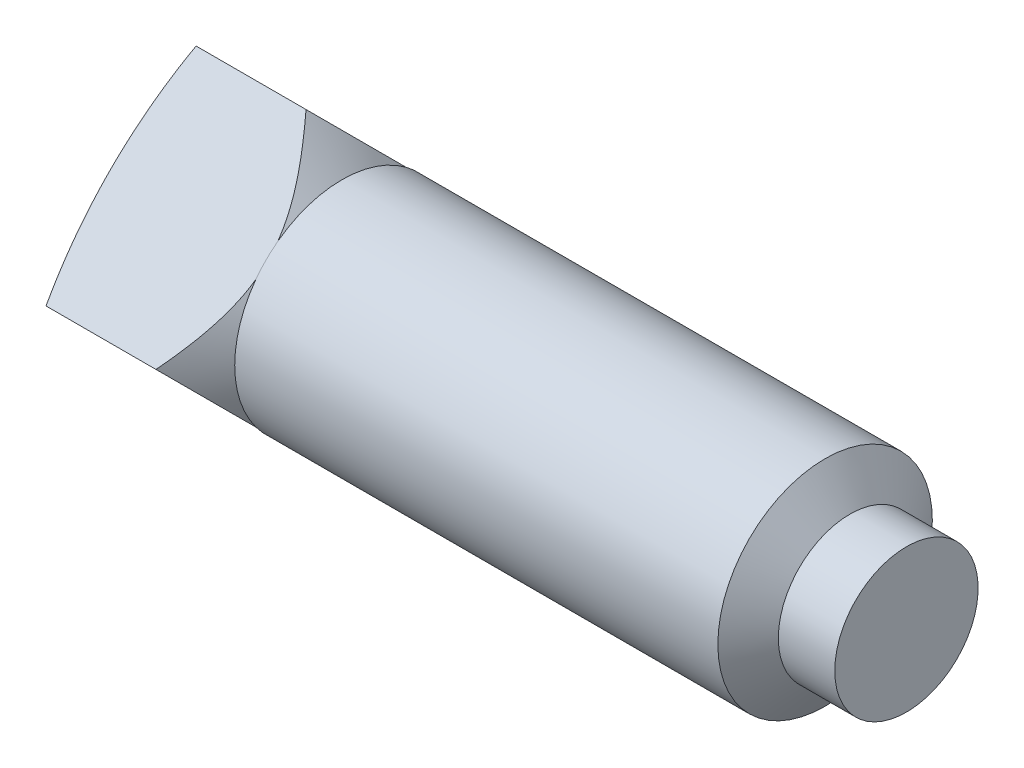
ISO-10303-21;
HEADER;
FILE_DESCRIPTION(('STEP AP214'),'2;1');
FILE_NAME('part.step','',(''),(''),'','','');
FILE_SCHEMA(('AUTOMOTIVE_DESIGN { 1 0 10303 214 1 1 1 1 }'));
ENDSEC;
DATA;
#1=APPLICATION_CONTEXT('core data for automotive mechanical design processes');
#2=APPLICATION_PROTOCOL_DEFINITION('international standard','automotive_design',2000,#1);
#3=PRODUCT_CONTEXT('',#1,'mechanical');
#4=PRODUCT('Part','Part','',(#3));
#5=PRODUCT_RELATED_PRODUCT_CATEGORY('part','',(#4));
#6=PRODUCT_DEFINITION_FORMATION('','',#4);
#7=PRODUCT_DEFINITION_CONTEXT('part definition',#1,'design');
#8=PRODUCT_DEFINITION('design','',#6,#7);
#9=PRODUCT_DEFINITION_SHAPE('','',#8);
#10=(LENGTH_UNIT() NAMED_UNIT(*) SI_UNIT(.MILLI.,.METRE.));
#11=(NAMED_UNIT(*) PLANE_ANGLE_UNIT() SI_UNIT($,.RADIAN.));
#12=(NAMED_UNIT(*) SI_UNIT($,.STERADIAN.) SOLID_ANGLE_UNIT());
#13=UNCERTAINTY_MEASURE_WITH_UNIT(LENGTH_MEASURE(1.E-05),#10,'distance_accuracy_value','');
#14=(GEOMETRIC_REPRESENTATION_CONTEXT(3) GLOBAL_UNCERTAINTY_ASSIGNED_CONTEXT((#13)) GLOBAL_UNIT_ASSIGNED_CONTEXT((#10,
#11,#12)) REPRESENTATION_CONTEXT('',''));
#15=CARTESIAN_POINT('',(0.,0.,0.));
#16=DIRECTION('',(0.,0.,1.));
#17=DIRECTION('',(1.,0.,0.));
#18=AXIS2_PLACEMENT_3D('',#15,#16,#17);
#19=CARTESIAN_POINT('',(-3.7592,0.,-3.376576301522));
#20=DIRECTION('',(0.,-0.707106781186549,0.707106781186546));
#21=DIRECTION('',(0.,-0.707106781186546,-0.707106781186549));
#22=AXIS2_PLACEMENT_3D('',#19,#20,#21);
#23=PLANE('',#22);
#24=CARTESIAN_POINT('',(-3.71463670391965,-2.84404188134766,-6.22061818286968));
#25=CARTESIAN_POINT('',(-3.55613835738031,-2.7014684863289,-6.07804478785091));
#26=CARTESIAN_POINT('',(-3.3981461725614,-2.55860959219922,-5.93518589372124));
#27=CARTESIAN_POINT('',(-3.08363247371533,-2.27203984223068,-5.64861614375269));
#28=CARTESIAN_POINT('',(-2.92711125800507,-2.12832882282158,-5.50490512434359));
#29=CARTESIAN_POINT('',(-2.61537743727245,-1.83919610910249,-5.2157724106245));
#30=CARTESIAN_POINT('',(-2.46017361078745,-1.69376967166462,-5.07034597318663));
#31=CARTESIAN_POINT('',(-2.15261018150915,-1.40143979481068,-4.77801609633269));
#32=CARTESIAN_POINT('',(-2.00025026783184,-1.25453651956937,-4.63111282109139));
#33=CARTESIAN_POINT('',(-1.72970912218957,-0.988182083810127,-4.36475838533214));
#34=CARTESIAN_POINT('',(-1.6107818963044,-0.869111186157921,-4.24568748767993));
#35=CARTESIAN_POINT('',(-1.37665028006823,-0.629105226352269,-4.00568152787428));
#36=CARTESIAN_POINT('',(-1.2614467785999,-0.508169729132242,-3.88474603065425));
#37=CARTESIAN_POINT('',(-1.03648369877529,-0.263755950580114,-3.64033225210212));
#38=CARTESIAN_POINT('',(-0.92672420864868,-0.140277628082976,-3.51685392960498));
#39=CARTESIAN_POINT('',(-0.768411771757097,0.0475823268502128,-3.32899397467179));
#40=CARTESIAN_POINT('',(-0.716703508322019,0.110632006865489,-3.26594429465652));
#41=CARTESIAN_POINT('',(-0.615958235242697,0.237786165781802,-3.13879013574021));
#42=CARTESIAN_POINT('',(-0.566920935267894,0.301890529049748,-3.07468577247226));
#43=CARTESIAN_POINT('',(-0.470564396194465,0.433616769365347,-2.94295953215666));
#44=CARTESIAN_POINT('',(-0.423365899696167,0.501283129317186,-2.87529317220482));
#45=CARTESIAN_POINT('',(-0.333664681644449,0.638144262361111,-2.73843203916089));
#46=CARTESIAN_POINT('',(-0.291160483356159,0.707338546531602,-2.6692377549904));
#47=CARTESIAN_POINT('',(-0.21229503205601,0.847303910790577,-2.52927239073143));
#48=CARTESIAN_POINT('',(-0.175920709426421,0.918071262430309,-2.4585050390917));
#49=CARTESIAN_POINT('',(-0.110910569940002,1.06137320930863,-2.31520309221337));
#50=CARTESIAN_POINT('',(-0.0822720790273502,1.1339071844,-2.24266911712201));
#51=CARTESIAN_POINT('',(-0.0393755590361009,1.26582470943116,-2.11075159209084));
#52=CARTESIAN_POINT('',(-0.0233846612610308,1.3249242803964,-2.0516520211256));
#53=CARTESIAN_POINT('',(0.00161538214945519,1.44386018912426,-1.93271611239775));
#54=CARTESIAN_POINT('',(0.0106258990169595,1.50369637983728,-1.87287992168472));
#55=CARTESIAN_POINT('',(0.021092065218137,1.62355655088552,-1.75301975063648));
#56=CARTESIAN_POINT('',(0.0225662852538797,1.68357970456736,-1.69299659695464));
#57=CARTESIAN_POINT('',(0.0179155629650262,1.80348109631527,-1.57309520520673));
#58=CARTESIAN_POINT('',(0.0117896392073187,1.86335931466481,-1.51321698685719));
#59=CARTESIAN_POINT('',(-0.0100815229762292,1.99721927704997,-1.37935702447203));
#60=CARTESIAN_POINT('',(-0.0278264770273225,2.0710373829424,-1.3055389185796));
#61=CARTESIAN_POINT('',(-0.0730208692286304,2.21718932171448,-1.15938697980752));
#62=CARTESIAN_POINT('',(-0.100477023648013,2.28952209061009,-1.08705421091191));
#63=CARTESIAN_POINT('',(-0.147658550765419,2.39694211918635,-0.97963418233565));
#64=CARTESIAN_POINT('',(-0.164455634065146,2.43269379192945,-0.943882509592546));
#65=CARTESIAN_POINT('',(-0.199813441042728,2.50374093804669,-0.872835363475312));
#66=CARTESIAN_POINT('',(-0.218373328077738,2.5390366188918,-0.837539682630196));
#67=CARTESIAN_POINT('',(-0.257053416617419,2.60919264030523,-0.76738366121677));
#68=CARTESIAN_POINT('',(-0.277173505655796,2.64405301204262,-0.73252328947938));
#69=CARTESIAN_POINT('',(-0.318791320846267,2.71336326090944,-0.663213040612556));
#70=CARTESIAN_POINT('',(-0.340289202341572,2.74781309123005,-0.628763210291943));
#71=CARTESIAN_POINT('',(-0.403215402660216,2.84534321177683,-0.53123308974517));
#72=CARTESIAN_POINT('',(-0.446099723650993,2.90795472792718,-0.468621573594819));
#73=CARTESIAN_POINT('',(-0.535121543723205,3.0320152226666,-0.344561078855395));
#74=CARTESIAN_POINT('',(-0.581259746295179,3.09346394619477,-0.283112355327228));
#75=CARTESIAN_POINT('',(-0.723571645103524,3.27639274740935,-0.100183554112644));
#76=CARTESIAN_POINT('',(-0.823588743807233,3.39637526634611,0.0197989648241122));
#77=CARTESIAN_POINT('',(-1.03047356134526,3.63375592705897,0.257179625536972));
#78=CARTESIAN_POINT('',(-1.13735948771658,3.75114599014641,0.374569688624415));
#79=CARTESIAN_POINT('',(-1.35557896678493,3.9837660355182,0.607189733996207));
#80=CARTESIAN_POINT('',(-1.4669107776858,4.09899683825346,0.722420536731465));
#81=CARTESIAN_POINT('',(-1.69305612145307,4.3282350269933,0.951658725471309));
#82=CARTESIAN_POINT('',(-1.8078789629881,4.44223779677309,1.06566149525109));
#83=CARTESIAN_POINT('',(-2.03983717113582,4.66907271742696,1.29249641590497));
#84=CARTESIAN_POINT('',(-2.1569727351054,4.78190476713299,1.405328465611));
#85=CARTESIAN_POINT('',(-2.39279712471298,5.00650286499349,1.6299265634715));
#86=CARTESIAN_POINT('',(-2.51148349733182,5.11827020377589,1.7416939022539));
#87=CARTESIAN_POINT('',(-2.75017246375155,5.34109999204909,1.9645236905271));
#88=CARTESIAN_POINT('',(-2.87017506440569,5.45216243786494,2.07558613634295));
#89=CARTESIAN_POINT('',(-3.05068333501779,5.61808795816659,2.2415116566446));
#90=CARTESIAN_POINT('',(-3.11080136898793,5.67316227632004,2.29658597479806));
#91=CARTESIAN_POINT('',(-3.23127854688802,5.78319708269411,2.40662078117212));
#92=CARTESIAN_POINT('',(-3.29163773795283,5.83815754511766,2.46158124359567));
#93=CARTESIAN_POINT('',(-3.41233885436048,5.94776482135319,2.5711885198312));
#94=CARTESIAN_POINT('',(-3.47268003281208,6.00241204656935,2.62583574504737));
#95=CARTESIAN_POINT('',(-3.59353260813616,6.11159399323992,2.73501769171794));
#96=CARTESIAN_POINT('',(-3.65404396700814,6.16612873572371,2.78955243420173));
#97=CARTESIAN_POINT('',(-3.71463670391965,6.22061818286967,2.84404188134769));
#98=B_SPLINE_CURVE_WITH_KNOTS('',3,(#24,#25,#26,#27,#28,#29,#30,#31,#32,#33,#34,#35,#36,#37,#38,
#39,#40,#41,#42,#43,#44,#45,#46,#47,#48,#49,#50,#51,#52,#53,#54,#55,#56,#57,#58,#59,#60,#61,#62,
#63,#64,#65,#66,#67,#68,#69,#70,#71,#72,#73,#74,#75,#76,#77,#78,#79,#80,#81,#82,#83,#84,#85,#86,
#87,#88,#89,#90,#91,#92,#93,#94,#95,#96,#97),.UNSPECIFIED.,.F.,.F.,(4,2,2,2,2,2,2,2,2,2,2,2,2,2,
2,2,2,2,2,2,2,2,2,2,2,2,2,2,2,2,2,2,2,2,2,2,4),(0.,0.769411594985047,1.53897600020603,
2.31192373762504,3.08478647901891,3.70321119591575,4.32178246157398,4.94036374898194,
5.24955145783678,5.55870549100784,5.87871228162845,6.19861811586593,6.51783299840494,
6.83693739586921,7.0919662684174,7.3469450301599,7.60129517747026,7.8556781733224,
8.17279662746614,8.49013483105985,8.64994152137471,8.80967274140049,8.96939245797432,
9.12913021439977,9.42418817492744,9.71931012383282,10.3099299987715,10.9021857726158,
11.4942117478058,12.0879855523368,12.6818102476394,13.2747881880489,13.8677692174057,
14.1629380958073,14.4581678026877,14.7523159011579,15.0464028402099),.UNSPECIFIED.);
#99=CARTESIAN_POINT('',(-0.808536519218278,0.,-3.376576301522));
#100=VERTEX_POINT('',#99);
#101=CARTESIAN_POINT('',(0.,1.44137193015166,-1.93520437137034));
#102=VERTEX_POINT('',#101);
#103=EDGE_CURVE('E166',#100,#102,#98,.T.);
#104=ORIENTED_EDGE('',*,*,#103,.F.);
#105=DIRECTION('',(1.,0.,0.));
#106=VECTOR('',#105,1.);
#107=CARTESIAN_POINT('',(-3.7592,0.,-3.376576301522));
#108=LINE('',#107,#106);
#109=CARTESIAN_POINT('',(-3.2823012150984,0.,-3.376576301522));
#110=VERTEX_POINT('',#109);
#111=EDGE_CURVE('E147',#110,#100,#108,.T.);
#112=ORIENTED_EDGE('',*,*,#111,.F.);
#113=CARTESIAN_POINT('',(8.4328,1.688288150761,-1.688288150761));
#114=DIRECTION('',(0.,-0.707106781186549,0.707106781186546));
#115=DIRECTION('',(0.,-0.707106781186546,-0.707106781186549));
#116=AXIS2_PLACEMENT_3D('',#113,#114,#115);
#117=CIRCLE('',#116,11.9559286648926);
#118=CARTESIAN_POINT('',(-3.2823012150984,3.376576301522,0.));
#119=VERTEX_POINT('',#118);
#120=EDGE_CURVE('E156',#119,#110,#117,.T.);
#121=ORIENTED_EDGE('',*,*,#120,.F.);
#122=DIRECTION('',(1.,0.,0.));
#123=VECTOR('',#122,1.);
#124=CARTESIAN_POINT('',(-3.7592,3.376576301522,0.));
#125=LINE('',#124,#123);
#126=CARTESIAN_POINT('',(-0.808536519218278,3.376576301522,0.));
#127=VERTEX_POINT('',#126);
#128=EDGE_CURVE('E154',#119,#127,#125,.T.);
#129=ORIENTED_EDGE('',*,*,#128,.T.);
#130=CARTESIAN_POINT('',(0.,1.93520437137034,-1.44137193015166));
#131=VERTEX_POINT('',#130);
#132=EDGE_CURVE('E177',#131,#127,#98,.T.);
#133=ORIENTED_EDGE('',*,*,#132,.F.);
#134=DIRECTION('',(0.,-0.707106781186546,-0.707106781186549));
#135=VECTOR('',#134,1.);
#136=CARTESIAN_POINT('',(0.,0.,-3.376576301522));
#137=LINE('',#136,#135);
#138=EDGE_CURVE('E47',#131,#102,#137,.T.);
#139=ORIENTED_EDGE('',*,*,#138,.T.);
#140=EDGE_LOOP('',(#104,#112,#121,#129,#133,#139));
#141=FACE_BOUND('',#140,.T.);
#142=ADVANCED_FACE('F39',(#141),#23,.F.);
#143=CARTESIAN_POINT('',(-3.7592,0.,-3.376576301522));
#144=DIRECTION('',(0.,0.707106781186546,0.707106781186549));
#145=DIRECTION('',(0.,-0.707106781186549,0.707106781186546));
#146=AXIS2_PLACEMENT_3D('',#143,#144,#145);
#147=PLANE('',#146);
#148=CARTESIAN_POINT('',(-3.71463670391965,-6.22061818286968,2.84404188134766));
#149=CARTESIAN_POINT('',(-3.55613835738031,-6.07804478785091,2.7014684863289));
#150=CARTESIAN_POINT('',(-3.3981461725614,-5.93518589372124,2.55860959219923));
#151=CARTESIAN_POINT('',(-3.08363247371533,-5.64861614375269,2.27203984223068));
#152=CARTESIAN_POINT('',(-2.92711125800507,-5.50490512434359,2.12832882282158));
#153=CARTESIAN_POINT('',(-2.61537743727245,-5.2157724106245,1.83919610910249));
#154=CARTESIAN_POINT('',(-2.46017361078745,-5.07034597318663,1.69376967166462));
#155=CARTESIAN_POINT('',(-2.15261018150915,-4.77801609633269,1.40143979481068));
#156=CARTESIAN_POINT('',(-2.00025026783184,-4.63111282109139,1.25453651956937));
#157=CARTESIAN_POINT('',(-1.72970912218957,-4.36475838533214,0.988182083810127));
#158=CARTESIAN_POINT('',(-1.6107818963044,-4.24568748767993,0.869111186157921));
#159=CARTESIAN_POINT('',(-1.37665028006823,-4.00568152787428,0.629105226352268));
#160=CARTESIAN_POINT('',(-1.2614467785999,-3.88474603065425,0.508169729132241));
#161=CARTESIAN_POINT('',(-1.03648369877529,-3.64033225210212,0.263755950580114));
#162=CARTESIAN_POINT('',(-0.92672420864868,-3.51685392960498,0.140277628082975));
#163=CARTESIAN_POINT('',(-0.768411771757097,-3.32899397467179,-0.0475823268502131));
#164=CARTESIAN_POINT('',(-0.716703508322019,-3.26594429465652,-0.11063200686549));
#165=CARTESIAN_POINT('',(-0.615958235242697,-3.13879013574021,-0.237786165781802));
#166=CARTESIAN_POINT('',(-0.566920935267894,-3.07468577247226,-0.301890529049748));
#167=CARTESIAN_POINT('',(-0.470564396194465,-2.94295953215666,-0.433616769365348));
#168=CARTESIAN_POINT('',(-0.423365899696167,-2.87529317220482,-0.501283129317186));
#169=CARTESIAN_POINT('',(-0.333664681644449,-2.73843203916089,-0.638144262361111));
#170=CARTESIAN_POINT('',(-0.291160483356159,-2.6692377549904,-0.707338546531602));
#171=CARTESIAN_POINT('',(-0.21229503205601,-2.52927239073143,-0.847303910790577));
#172=CARTESIAN_POINT('',(-0.175920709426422,-2.4585050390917,-0.918071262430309));
#173=CARTESIAN_POINT('',(-0.110910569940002,-2.31520309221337,-1.06137320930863));
#174=CARTESIAN_POINT('',(-0.0822720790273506,-2.24266911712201,-1.1339071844));
#175=CARTESIAN_POINT('',(-0.0393755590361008,-2.11075159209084,-1.26582470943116));
#176=CARTESIAN_POINT('',(-0.0233846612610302,-2.0516520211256,-1.3249242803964));
#177=CARTESIAN_POINT('',(0.00161538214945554,-1.93271611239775,-1.44386018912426));
#178=CARTESIAN_POINT('',(0.0106258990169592,-1.87287992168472,-1.50369637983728));
#179=CARTESIAN_POINT('',(0.0210920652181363,-1.75301975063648,-1.62355655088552));
#180=CARTESIAN_POINT('',(0.0225662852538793,-1.69299659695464,-1.68357970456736));
#181=CARTESIAN_POINT('',(0.0179155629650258,-1.57309520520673,-1.80348109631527));
#182=CARTESIAN_POINT('',(0.0117896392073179,-1.51321698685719,-1.86335931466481));
#183=CARTESIAN_POINT('',(-0.01008152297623,-1.37935702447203,-1.99721927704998));
#184=CARTESIAN_POINT('',(-0.0278264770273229,-1.3055389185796,-2.0710373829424));
#185=CARTESIAN_POINT('',(-0.0730208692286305,-1.15938697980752,-2.21718932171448));
#186=CARTESIAN_POINT('',(-0.100477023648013,-1.08705421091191,-2.28952209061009));
#187=CARTESIAN_POINT('',(-0.14765855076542,-0.97963418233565,-2.39694211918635));
#188=CARTESIAN_POINT('',(-0.164455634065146,-0.943882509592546,-2.43269379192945));
#189=CARTESIAN_POINT('',(-0.199813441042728,-0.872835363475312,-2.50374093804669));
#190=CARTESIAN_POINT('',(-0.218373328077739,-0.837539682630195,-2.5390366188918));
#191=CARTESIAN_POINT('',(-0.25705341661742,-0.767383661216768,-2.60919264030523));
#192=CARTESIAN_POINT('',(-0.277173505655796,-0.732523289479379,-2.64405301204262));
#193=CARTESIAN_POINT('',(-0.318791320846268,-0.663213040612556,-2.71336326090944));
#194=CARTESIAN_POINT('',(-0.340289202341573,-0.628763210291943,-2.74781309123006));
#195=CARTESIAN_POINT('',(-0.403215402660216,-0.53123308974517,-2.84534321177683));
#196=CARTESIAN_POINT('',(-0.446099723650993,-0.46862157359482,-2.90795472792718));
#197=CARTESIAN_POINT('',(-0.535121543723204,-0.344561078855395,-3.0320152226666));
#198=CARTESIAN_POINT('',(-0.581259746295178,-0.283112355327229,-3.09346394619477));
#199=CARTESIAN_POINT('',(-0.723571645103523,-0.100183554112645,-3.27639274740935));
#200=CARTESIAN_POINT('',(-0.823588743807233,0.0197989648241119,-3.39637526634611));
#201=CARTESIAN_POINT('',(-1.03047356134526,0.257179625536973,-3.63375592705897));
#202=CARTESIAN_POINT('',(-1.13735948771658,0.374569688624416,-3.75114599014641));
#203=CARTESIAN_POINT('',(-1.35557896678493,0.607189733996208,-3.9837660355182));
#204=CARTESIAN_POINT('',(-1.4669107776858,0.722420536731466,-4.09899683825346));
#205=CARTESIAN_POINT('',(-1.69305612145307,0.951658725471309,-4.3282350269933));
#206=CARTESIAN_POINT('',(-1.8078789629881,1.0656614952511,-4.44223779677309));
#207=CARTESIAN_POINT('',(-2.03983717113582,1.29249641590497,-4.66907271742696));
#208=CARTESIAN_POINT('',(-2.1569727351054,1.405328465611,-4.78190476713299));
#209=CARTESIAN_POINT('',(-2.39279712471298,1.6299265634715,-5.00650286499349));
#210=CARTESIAN_POINT('',(-2.51148349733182,1.7416939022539,-5.11827020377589));
#211=CARTESIAN_POINT('',(-2.75017246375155,1.9645236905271,-5.34109999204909));
#212=CARTESIAN_POINT('',(-2.87017506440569,2.07558613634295,-5.45216243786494));
#213=CARTESIAN_POINT('',(-3.05068333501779,2.2415116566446,-5.61808795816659));
#214=CARTESIAN_POINT('',(-3.11080136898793,2.29658597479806,-5.67316227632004));
#215=CARTESIAN_POINT('',(-3.23127854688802,2.40662078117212,-5.78319708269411));
#216=CARTESIAN_POINT('',(-3.29163773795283,2.46158124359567,-5.83815754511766));
#217=CARTESIAN_POINT('',(-3.41233885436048,2.5711885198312,-5.94776482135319));
#218=CARTESIAN_POINT('',(-3.47268003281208,2.62583574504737,-6.00241204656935));
#219=CARTESIAN_POINT('',(-3.59353260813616,2.73501769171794,-6.11159399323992));
#220=CARTESIAN_POINT('',(-3.65404396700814,2.78955243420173,-6.16612873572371));
#221=CARTESIAN_POINT('',(-3.71463670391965,2.84404188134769,-6.22061818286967));
#222=B_SPLINE_CURVE_WITH_KNOTS('',3,(#148,#149,#150,#151,#152,#153,#154,#155,#156,#157,#158,
#159,#160,#161,#162,#163,#164,#165,#166,#167,#168,#169,#170,#171,#172,#173,#174,#175,#176,#177,
#178,#179,#180,#181,#182,#183,#184,#185,#186,#187,#188,#189,#190,#191,#192,#193,#194,#195,#196,
#197,#198,#199,#200,#201,#202,#203,#204,#205,#206,#207,#208,#209,#210,#211,#212,#213,#214,#215,
#216,#217,#218,#219,#220,#221),.UNSPECIFIED.,.F.,.F.,(4,2,2,2,2,2,2,2,2,2,2,2,2,2,2,2,2,2,2,2,2,
2,2,2,2,2,2,2,2,2,2,2,2,2,2,2,4),(0.,0.769411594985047,1.53897600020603,2.31192373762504,
3.08478647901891,3.70321119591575,4.32178246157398,4.94036374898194,5.24955145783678,
5.55870549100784,5.87871228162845,6.19861811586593,6.51783299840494,6.83693739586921,
7.0919662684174,7.3469450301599,7.60129517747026,7.8556781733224,8.17279662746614,
8.49013483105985,8.64994152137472,8.80967274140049,8.96939245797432,9.12913021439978,
9.42418817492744,9.71931012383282,10.3099299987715,10.9021857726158,11.4942117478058,
12.0879855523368,12.6818102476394,13.2747881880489,13.8677692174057,14.1629380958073,
14.4581678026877,14.7523159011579,15.0464028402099),.UNSPECIFIED.);
#223=CARTESIAN_POINT('',(-0.808536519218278,-3.376576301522,0.));
#224=VERTEX_POINT('',#223);
#225=CARTESIAN_POINT('',(0.,-1.93520437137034,-1.44137193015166));
#226=VERTEX_POINT('',#225);
#227=EDGE_CURVE('E167',#224,#226,#222,.T.);
#228=ORIENTED_EDGE('',*,*,#227,.F.);
#229=DIRECTION('',(1.,0.,0.));
#230=VECTOR('',#229,1.);
#231=CARTESIAN_POINT('',(-3.7592,-3.376576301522,0.));
#232=LINE('',#231,#230);
#233=CARTESIAN_POINT('',(-3.2823012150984,-3.376576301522,0.));
#234=VERTEX_POINT('',#233);
#235=EDGE_CURVE('E150',#234,#224,#232,.T.);
#236=ORIENTED_EDGE('',*,*,#235,.F.);
#237=CARTESIAN_POINT('',(8.4328,-1.688288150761,-1.688288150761));
#238=DIRECTION('',(0.,0.707106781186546,0.707106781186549));
#239=DIRECTION('',(0.,-0.707106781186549,0.707106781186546));
#240=AXIS2_PLACEMENT_3D('',#237,#238,#239);
#241=CIRCLE('',#240,11.9559286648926);
#242=EDGE_CURVE('E163',#110,#234,#241,.T.);
#243=ORIENTED_EDGE('',*,*,#242,.F.);
#244=ORIENTED_EDGE('',*,*,#111,.T.);
#245=CARTESIAN_POINT('',(0.,-1.44137193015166,-1.93520437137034));
#246=VERTEX_POINT('',#245);
#247=EDGE_CURVE('E175',#246,#100,#222,.T.);
#248=ORIENTED_EDGE('',*,*,#247,.F.);
#249=DIRECTION('',(0.,-0.707106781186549,0.707106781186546));
#250=VECTOR('',#249,1.);
#251=CARTESIAN_POINT('',(0.,0.,-3.376576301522));
#252=LINE('',#251,#250);
#253=EDGE_CURVE('E134',#246,#226,#252,.T.);
#254=ORIENTED_EDGE('',*,*,#253,.T.);
#255=EDGE_LOOP('',(#228,#236,#243,#244,#248,#254));
#256=FACE_BOUND('',#255,.T.);
#257=ADVANCED_FACE('F184',(#256),#147,.F.);
#258=CARTESIAN_POINT('',(-3.7592,-3.376576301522,0.));
#259=DIRECTION('',(0.,0.707106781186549,-0.707106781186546));
#260=DIRECTION('',(0.,0.707106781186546,0.707106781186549));
#261=AXIS2_PLACEMENT_3D('',#258,#259,#260);
#262=PLANE('',#261);
#263=CARTESIAN_POINT('',(-3.71463670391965,2.84404188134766,6.22061818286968));
#264=CARTESIAN_POINT('',(-3.55613835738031,2.70146848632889,6.07804478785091));
#265=CARTESIAN_POINT('',(-3.3981461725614,2.55860959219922,5.93518589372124));
#266=CARTESIAN_POINT('',(-3.08363247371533,2.27203984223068,5.64861614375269));
#267=CARTESIAN_POINT('',(-2.92711125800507,2.12832882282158,5.50490512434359));
#268=CARTESIAN_POINT('',(-2.61537743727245,1.83919610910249,5.2157724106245));
#269=CARTESIAN_POINT('',(-2.46017361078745,1.69376967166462,5.07034597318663));
#270=CARTESIAN_POINT('',(-2.15261018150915,1.40143979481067,4.77801609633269));
#271=CARTESIAN_POINT('',(-2.00025026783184,1.25453651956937,4.63111282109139));
#272=CARTESIAN_POINT('',(-1.72970912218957,0.988182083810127,4.36475838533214));
#273=CARTESIAN_POINT('',(-1.6107818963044,0.869111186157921,4.24568748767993));
#274=CARTESIAN_POINT('',(-1.37665028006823,0.629105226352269,4.00568152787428));
#275=CARTESIAN_POINT('',(-1.2614467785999,0.508169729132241,3.88474603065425));
#276=CARTESIAN_POINT('',(-1.03648369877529,0.263755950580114,3.64033225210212));
#277=CARTESIAN_POINT('',(-0.926724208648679,0.140277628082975,3.51685392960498));
#278=CARTESIAN_POINT('',(-0.768411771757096,-0.0475823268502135,3.32899397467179));
#279=CARTESIAN_POINT('',(-0.716703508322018,-0.11063200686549,3.26594429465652));
#280=CARTESIAN_POINT('',(-0.615958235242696,-0.237786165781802,3.1387901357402));
#281=CARTESIAN_POINT('',(-0.566920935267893,-0.301890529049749,3.07468577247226));
#282=CARTESIAN_POINT('',(-0.470564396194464,-0.433616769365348,2.94295953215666));
#283=CARTESIAN_POINT('',(-0.423365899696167,-0.501283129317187,2.87529317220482));
#284=CARTESIAN_POINT('',(-0.333664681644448,-0.638144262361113,2.73843203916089));
#285=CARTESIAN_POINT('',(-0.291160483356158,-0.707338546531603,2.6692377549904));
#286=CARTESIAN_POINT('',(-0.212295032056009,-0.847303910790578,2.52927239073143));
#287=CARTESIAN_POINT('',(-0.175920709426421,-0.91807126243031,2.4585050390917));
#288=CARTESIAN_POINT('',(-0.110910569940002,-1.06137320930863,2.31520309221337));
#289=CARTESIAN_POINT('',(-0.0822720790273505,-1.1339071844,2.24266911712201));
#290=CARTESIAN_POINT('',(-0.0393755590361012,-1.26582470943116,2.11075159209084));
#291=CARTESIAN_POINT('',(-0.0233846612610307,-1.3249242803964,2.0516520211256));
#292=CARTESIAN_POINT('',(0.00161538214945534,-1.44386018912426,1.93271611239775));
#293=CARTESIAN_POINT('',(0.0106258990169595,-1.50369637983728,1.87287992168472));
#294=CARTESIAN_POINT('',(0.0210920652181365,-1.62355655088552,1.75301975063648));
#295=CARTESIAN_POINT('',(0.0225662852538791,-1.68357970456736,1.69299659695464));
#296=CARTESIAN_POINT('',(0.0179155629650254,-1.80348109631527,1.57309520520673));
#297=CARTESIAN_POINT('',(0.0117896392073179,-1.86335931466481,1.51321698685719));
#298=CARTESIAN_POINT('',(-0.0100815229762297,-1.99721927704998,1.37935702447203));
#299=CARTESIAN_POINT('',(-0.0278264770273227,-2.0710373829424,1.3055389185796));
#300=CARTESIAN_POINT('',(-0.0730208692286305,-2.21718932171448,1.15938697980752));
#301=CARTESIAN_POINT('',(-0.100477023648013,-2.28952209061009,1.08705421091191));
#302=CARTESIAN_POINT('',(-0.14765855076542,-2.39694211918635,0.979634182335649));
#303=CARTESIAN_POINT('',(-0.164455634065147,-2.43269379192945,0.943882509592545));
#304=CARTESIAN_POINT('',(-0.199813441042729,-2.50374093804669,0.872835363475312));
#305=CARTESIAN_POINT('',(-0.218373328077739,-2.5390366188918,0.837539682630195));
#306=CARTESIAN_POINT('',(-0.257053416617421,-2.60919264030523,0.767383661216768));
#307=CARTESIAN_POINT('',(-0.277173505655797,-2.64405301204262,0.732523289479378));
#308=CARTESIAN_POINT('',(-0.318791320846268,-2.71336326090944,0.663213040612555));
#309=CARTESIAN_POINT('',(-0.340289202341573,-2.74781309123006,0.628763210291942));
#310=CARTESIAN_POINT('',(-0.403215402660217,-2.84534321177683,0.531233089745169));
#311=CARTESIAN_POINT('',(-0.446099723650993,-2.90795472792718,0.468621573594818));
#312=CARTESIAN_POINT('',(-0.535121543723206,-3.0320152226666,0.344561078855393));
#313=CARTESIAN_POINT('',(-0.58125974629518,-3.09346394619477,0.283112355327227));
#314=CARTESIAN_POINT('',(-0.723571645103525,-3.27639274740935,0.100183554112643));
#315=CARTESIAN_POINT('',(-0.823588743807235,-3.39637526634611,-0.019798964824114));
#316=CARTESIAN_POINT('',(-1.03047356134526,-3.63375592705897,-0.257179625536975));
#317=CARTESIAN_POINT('',(-1.13735948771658,-3.75114599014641,-0.374569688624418));
#318=CARTESIAN_POINT('',(-1.35557896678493,-3.98376603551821,-0.607189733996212));
#319=CARTESIAN_POINT('',(-1.4669107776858,-4.09899683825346,-0.72242053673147));
#320=CARTESIAN_POINT('',(-1.69305612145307,-4.32823502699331,-0.951658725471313));
#321=CARTESIAN_POINT('',(-1.80787896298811,-4.44223779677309,-1.0656614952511));
#322=CARTESIAN_POINT('',(-2.03983717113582,-4.66907271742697,-1.29249641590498));
#323=CARTESIAN_POINT('',(-2.1569727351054,-4.78190476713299,-1.405328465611));
#324=CARTESIAN_POINT('',(-2.39279712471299,-5.0065028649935,-1.62992656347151));
#325=CARTESIAN_POINT('',(-2.51148349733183,-5.11827020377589,-1.74169390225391));
#326=CARTESIAN_POINT('',(-2.75017246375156,-5.3410999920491,-1.96452369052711));
#327=CARTESIAN_POINT('',(-2.8701750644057,-5.45216243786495,-2.07558613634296));
#328=CARTESIAN_POINT('',(-3.05068333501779,-5.6180879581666,-2.24151165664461));
#329=CARTESIAN_POINT('',(-3.11080136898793,-5.67316227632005,-2.29658597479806));
#330=CARTESIAN_POINT('',(-3.23127854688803,-5.78319708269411,-2.40662078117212));
#331=CARTESIAN_POINT('',(-3.29163773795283,-5.83815754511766,-2.46158124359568));
#332=CARTESIAN_POINT('',(-3.41233885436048,-5.94776482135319,-2.57118851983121));
#333=CARTESIAN_POINT('',(-3.47268003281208,-6.00241204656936,-2.62583574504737));
#334=CARTESIAN_POINT('',(-3.59353260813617,-6.11159399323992,-2.73501769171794));
#335=CARTESIAN_POINT('',(-3.65404396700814,-6.16612873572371,-2.78955243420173));
#336=CARTESIAN_POINT('',(-3.71463670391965,-6.22061818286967,-2.84404188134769));
#337=B_SPLINE_CURVE_WITH_KNOTS('',3,(#263,#264,#265,#266,#267,#268,#269,#270,#271,#272,#273,
#274,#275,#276,#277,#278,#279,#280,#281,#282,#283,#284,#285,#286,#287,#288,#289,#290,#291,#292,
#293,#294,#295,#296,#297,#298,#299,#300,#301,#302,#303,#304,#305,#306,#307,#308,#309,#310,#311,
#312,#313,#314,#315,#316,#317,#318,#319,#320,#321,#322,#323,#324,#325,#326,#327,#328,#329,#330,
#331,#332,#333,#334,#335,#336),.UNSPECIFIED.,.F.,.F.,(4,2,2,2,2,2,2,2,2,2,2,2,2,2,2,2,2,2,2,2,2,
2,2,2,2,2,2,2,2,2,2,2,2,2,2,2,4),(0.,0.769411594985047,1.53897600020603,2.31192373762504,
3.08478647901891,3.70321119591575,4.32178246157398,4.94036374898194,5.24955145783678,
5.55870549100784,5.87871228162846,6.19861811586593,6.51783299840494,6.83693739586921,
7.0919662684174,7.34694503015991,7.60129517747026,7.8556781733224,8.17279662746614,
8.49013483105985,8.64994152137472,8.80967274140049,8.96939245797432,9.12913021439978,
9.42418817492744,9.71931012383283,10.3099299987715,10.9021857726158,11.4942117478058,
12.0879855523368,12.6818102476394,13.2747881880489,13.8677692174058,14.1629380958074,
14.4581678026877,14.7523159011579,15.0464028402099),.UNSPECIFIED.);
#338=CARTESIAN_POINT('',(-0.808536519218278,0.,3.376576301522));
#339=VERTEX_POINT('',#338);
#340=CARTESIAN_POINT('',(0.,-1.44137193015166,1.93520437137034));
#341=VERTEX_POINT('',#340);
#342=EDGE_CURVE('E61',#339,#341,#337,.T.);
#343=ORIENTED_EDGE('',*,*,#342,.F.);
#344=DIRECTION('',(1.,0.,0.));
#345=VECTOR('',#344,1.);
#346=CARTESIAN_POINT('',(-3.7592,0.,3.376576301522));
#347=LINE('',#346,#345);
#348=CARTESIAN_POINT('',(-3.2823012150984,0.,3.376576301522));
#349=VERTEX_POINT('',#348);
#350=EDGE_CURVE('E122',#349,#339,#347,.T.);
#351=ORIENTED_EDGE('',*,*,#350,.F.);
#352=CARTESIAN_POINT('',(8.4328,-1.688288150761,1.688288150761));
#353=DIRECTION('',(0.,0.707106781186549,-0.707106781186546));
#354=DIRECTION('',(0.,0.707106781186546,0.707106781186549));
#355=AXIS2_PLACEMENT_3D('',#352,#353,#354);
#356=CIRCLE('',#355,11.9559286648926);
#357=EDGE_CURVE('E53',#234,#349,#356,.T.);
#358=ORIENTED_EDGE('',*,*,#357,.F.);
#359=ORIENTED_EDGE('',*,*,#235,.T.);
#360=CARTESIAN_POINT('',(0.,-1.93520437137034,1.44137193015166));
#361=VERTEX_POINT('',#360);
#362=EDGE_CURVE('E176',#361,#224,#337,.T.);
#363=ORIENTED_EDGE('',*,*,#362,.F.);
#364=DIRECTION('',(0.,0.707106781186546,0.707106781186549));
#365=VECTOR('',#364,1.);
#366=CARTESIAN_POINT('',(0.,-3.376576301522,0.));
#367=LINE('',#366,#365);
#368=EDGE_CURVE('E128',#361,#341,#367,.T.);
#369=ORIENTED_EDGE('',*,*,#368,.T.);
#370=EDGE_LOOP('',(#343,#351,#358,#359,#363,#369));
#371=FACE_BOUND('',#370,.T.);
#372=ADVANCED_FACE('F207',(#371),#262,.F.);
#373=CARTESIAN_POINT('',(-3.7592,3.376576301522,0.));
#374=DIRECTION('',(0.,-0.707106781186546,-0.707106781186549));
#375=DIRECTION('',(0.,0.707106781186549,-0.707106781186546));
#376=AXIS2_PLACEMENT_3D('',#373,#374,#375);
#377=PLANE('',#376);
#378=CARTESIAN_POINT('',(-3.71463670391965,6.22061818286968,-2.84404188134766));
#379=CARTESIAN_POINT('',(-3.55613835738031,6.07804478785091,-2.70146848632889));
#380=CARTESIAN_POINT('',(-3.3981461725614,5.93518589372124,-2.55860959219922));
#381=CARTESIAN_POINT('',(-3.08363247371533,5.64861614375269,-2.27203984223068));
#382=CARTESIAN_POINT('',(-2.92711125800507,5.50490512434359,-2.12832882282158));
#383=CARTESIAN_POINT('',(-2.61537743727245,5.2157724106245,-1.83919610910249));
#384=CARTESIAN_POINT('',(-2.46017361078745,5.07034597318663,-1.69376967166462));
#385=CARTESIAN_POINT('',(-2.15261018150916,4.77801609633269,-1.40143979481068));
#386=CARTESIAN_POINT('',(-2.00025026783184,4.63111282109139,-1.25453651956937));
#387=CARTESIAN_POINT('',(-1.72970912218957,4.36475838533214,-0.988182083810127));
#388=CARTESIAN_POINT('',(-1.6107818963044,4.24568748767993,-0.869111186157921));
#389=CARTESIAN_POINT('',(-1.37665028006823,4.00568152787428,-0.629105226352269));
#390=CARTESIAN_POINT('',(-1.2614467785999,3.88474603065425,-0.508169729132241));
#391=CARTESIAN_POINT('',(-1.03648369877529,3.64033225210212,-0.263755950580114));
#392=CARTESIAN_POINT('',(-0.926724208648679,3.51685392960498,-0.140277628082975));
#393=CARTESIAN_POINT('',(-0.768411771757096,3.32899397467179,0.0475823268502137));
#394=CARTESIAN_POINT('',(-0.716703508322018,3.26594429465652,0.110632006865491));
#395=CARTESIAN_POINT('',(-0.615958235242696,3.1387901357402,0.237786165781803));
#396=CARTESIAN_POINT('',(-0.566920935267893,3.07468577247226,0.301890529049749));
#397=CARTESIAN_POINT('',(-0.470564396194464,2.94295953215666,0.433616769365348));
#398=CARTESIAN_POINT('',(-0.423365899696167,2.87529317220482,0.501283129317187));
#399=CARTESIAN_POINT('',(-0.333664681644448,2.73843203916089,0.638144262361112));
#400=CARTESIAN_POINT('',(-0.291160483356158,2.6692377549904,0.707338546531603));
#401=CARTESIAN_POINT('',(-0.212295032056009,2.52927239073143,0.847303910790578));
#402=CARTESIAN_POINT('',(-0.175920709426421,2.45850503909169,0.91807126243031));
#403=CARTESIAN_POINT('',(-0.110910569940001,2.31520309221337,1.06137320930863));
#404=CARTESIAN_POINT('',(-0.0822720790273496,2.24266911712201,1.1339071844));
#405=CARTESIAN_POINT('',(-0.0393755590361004,2.11075159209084,1.26582470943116));
#406=CARTESIAN_POINT('',(-0.0233846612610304,2.0516520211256,1.3249242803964));
#407=CARTESIAN_POINT('',(0.00161538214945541,1.93271611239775,1.44386018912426));
#408=CARTESIAN_POINT('',(0.0106258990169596,1.87287992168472,1.50369637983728));
#409=CARTESIAN_POINT('',(0.0210920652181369,1.75301975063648,1.62355655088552));
#410=CARTESIAN_POINT('',(0.0225662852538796,1.69299659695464,1.68357970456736));
#411=CARTESIAN_POINT('',(0.0179155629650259,1.57309520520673,1.80348109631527));
#412=CARTESIAN_POINT('',(0.0117896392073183,1.51321698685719,1.86335931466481));
#413=CARTESIAN_POINT('',(-0.0100815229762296,1.37935702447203,1.99721927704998));
#414=CARTESIAN_POINT('',(-0.0278264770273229,1.3055389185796,2.0710373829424));
#415=CARTESIAN_POINT('',(-0.0730208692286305,1.15938697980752,2.21718932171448));
#416=CARTESIAN_POINT('',(-0.100477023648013,1.08705421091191,2.28952209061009));
#417=CARTESIAN_POINT('',(-0.14765855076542,0.979634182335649,2.39694211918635));
#418=CARTESIAN_POINT('',(-0.164455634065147,0.943882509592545,2.43269379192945));
#419=CARTESIAN_POINT('',(-0.199813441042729,0.872835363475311,2.50374093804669));
#420=CARTESIAN_POINT('',(-0.218373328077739,0.837539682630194,2.5390366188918));
#421=CARTESIAN_POINT('',(-0.25705341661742,0.767383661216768,2.60919264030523));
#422=CARTESIAN_POINT('',(-0.277173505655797,0.732523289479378,2.64405301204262));
#423=CARTESIAN_POINT('',(-0.318791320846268,0.663213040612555,2.71336326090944));
#424=CARTESIAN_POINT('',(-0.340289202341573,0.628763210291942,2.74781309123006));
#425=CARTESIAN_POINT('',(-0.403215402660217,0.531233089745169,2.84534321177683));
#426=CARTESIAN_POINT('',(-0.446099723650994,0.468621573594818,2.90795472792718));
#427=CARTESIAN_POINT('',(-0.535121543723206,0.344561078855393,3.0320152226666));
#428=CARTESIAN_POINT('',(-0.58125974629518,0.283112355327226,3.09346394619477));
#429=CARTESIAN_POINT('',(-0.723571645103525,0.100183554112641,3.27639274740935));
#430=CARTESIAN_POINT('',(-0.823588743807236,-0.0197989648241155,3.39637526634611));
#431=CARTESIAN_POINT('',(-1.03047356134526,-0.257179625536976,3.63375592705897));
#432=CARTESIAN_POINT('',(-1.13735948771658,-0.37456968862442,3.75114599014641));
#433=CARTESIAN_POINT('',(-1.35557896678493,-0.607189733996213,3.98376603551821));
#434=CARTESIAN_POINT('',(-1.4669107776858,-0.72242053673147,4.09899683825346));
#435=CARTESIAN_POINT('',(-1.69305612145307,-0.951658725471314,4.32823502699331));
#436=CARTESIAN_POINT('',(-1.80787896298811,-1.0656614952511,4.44223779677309));
#437=CARTESIAN_POINT('',(-2.03983717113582,-1.29249641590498,4.66907271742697));
#438=CARTESIAN_POINT('',(-2.1569727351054,-1.405328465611,4.78190476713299));
#439=CARTESIAN_POINT('',(-2.39279712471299,-1.62992656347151,5.0065028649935));
#440=CARTESIAN_POINT('',(-2.51148349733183,-1.74169390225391,5.1182702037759));
#441=CARTESIAN_POINT('',(-2.75017246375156,-1.96452369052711,5.3410999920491));
#442=CARTESIAN_POINT('',(-2.8701750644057,-2.07558613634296,5.45216243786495));
#443=CARTESIAN_POINT('',(-3.0506833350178,-2.24151165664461,5.6180879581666));
#444=CARTESIAN_POINT('',(-3.11080136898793,-2.29658597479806,5.67316227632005));
#445=CARTESIAN_POINT('',(-3.23127854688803,-2.40662078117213,5.78319708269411));
#446=CARTESIAN_POINT('',(-3.29163773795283,-2.46158124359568,5.83815754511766));
#447=CARTESIAN_POINT('',(-3.41233885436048,-2.57118851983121,5.94776482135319));
#448=CARTESIAN_POINT('',(-3.47268003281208,-2.62583574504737,6.00241204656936));
#449=CARTESIAN_POINT('',(-3.59353260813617,-2.73501769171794,6.11159399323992));
#450=CARTESIAN_POINT('',(-3.65404396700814,-2.78955243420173,6.16612873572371));
#451=CARTESIAN_POINT('',(-3.71463670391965,-2.84404188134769,6.22061818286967));
#452=B_SPLINE_CURVE_WITH_KNOTS('',3,(#378,#379,#380,#381,#382,#383,#384,#385,#386,#387,#388,
#389,#390,#391,#392,#393,#394,#395,#396,#397,#398,#399,#400,#401,#402,#403,#404,#405,#406,#407,
#408,#409,#410,#411,#412,#413,#414,#415,#416,#417,#418,#419,#420,#421,#422,#423,#424,#425,#426,
#427,#428,#429,#430,#431,#432,#433,#434,#435,#436,#437,#438,#439,#440,#441,#442,#443,#444,#445,
#446,#447,#448,#449,#450,#451),.UNSPECIFIED.,.F.,.F.,(4,2,2,2,2,2,2,2,2,2,2,2,2,2,2,2,2,2,2,2,2,
2,2,2,2,2,2,2,2,2,2,2,2,2,2,2,4),(0.,0.769411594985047,1.53897600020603,2.31192373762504,
3.08478647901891,3.70321119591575,4.32178246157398,4.94036374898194,5.24955145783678,
5.55870549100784,5.87871228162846,6.19861811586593,6.51783299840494,6.83693739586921,
7.0919662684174,7.34694503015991,7.60129517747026,7.8556781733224,8.17279662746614,
8.49013483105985,8.64994152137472,8.80967274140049,8.96939245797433,9.12913021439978,
9.42418817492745,9.71931012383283,10.3099299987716,10.9021857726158,11.4942117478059,
12.0879855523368,12.6818102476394,13.2747881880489,13.8677692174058,14.1629380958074,
14.4581678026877,14.752315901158,15.0464028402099),.UNSPECIFIED.);
#453=CARTESIAN_POINT('',(0.,1.93520437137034,1.44137193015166));
#454=VERTEX_POINT('',#453);
#455=EDGE_CURVE('E124',#127,#454,#452,.T.);
#456=ORIENTED_EDGE('',*,*,#455,.F.);
#457=ORIENTED_EDGE('',*,*,#128,.F.);
#458=CARTESIAN_POINT('',(8.4328,1.688288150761,1.688288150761));
#459=DIRECTION('',(0.,-0.707106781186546,-0.707106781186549));
#460=DIRECTION('',(0.,0.707106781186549,-0.707106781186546));
#461=AXIS2_PLACEMENT_3D('',#458,#459,#460);
#462=CIRCLE('',#461,11.9559286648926);
#463=EDGE_CURVE('E11',#349,#119,#462,.T.);
#464=ORIENTED_EDGE('',*,*,#463,.F.);
#465=ORIENTED_EDGE('',*,*,#350,.T.);
#466=CARTESIAN_POINT('',(0.,1.44137193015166,1.93520437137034));
#467=VERTEX_POINT('',#466);
#468=EDGE_CURVE('E106',#467,#339,#452,.T.);
#469=ORIENTED_EDGE('',*,*,#468,.F.);
#470=DIRECTION('',(0.,0.707106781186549,-0.707106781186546));
#471=VECTOR('',#470,1.);
#472=CARTESIAN_POINT('',(0.,3.376576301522,0.));
#473=LINE('',#472,#471);
#474=EDGE_CURVE('E120',#467,#454,#473,.T.);
#475=ORIENTED_EDGE('',*,*,#474,.T.);
#476=EDGE_LOOP('',(#456,#457,#464,#465,#469,#475));
#477=FACE_BOUND('',#476,.T.);
#478=ADVANCED_FACE('F119',(#477),#377,.F.);
#479=CARTESIAN_POINT('',(0.,0.,0.));
#480=DIRECTION('',(-1.,0.,0.));
#481=DIRECTION('',(0.,0.,1.));
#482=AXIS2_PLACEMENT_3D('',#479,#480,#481);
#483=PLANE('',#482);
#484=ORIENTED_EDGE('',*,*,#138,.F.);
#485=CARTESIAN_POINT('',(0.,0.,0.));
#486=DIRECTION('',(-1.,0.,0.));
#487=DIRECTION('',(0.,0.,1.));
#488=AXIS2_PLACEMENT_3D('',#485,#486,#487);
#489=CIRCLE('',#488,2.413);
#490=EDGE_CURVE('E137',#131,#102,#489,.T.);
#491=ORIENTED_EDGE('',*,*,#490,.T.);
#492=EDGE_LOOP('',(#484,#491));
#493=FACE_BOUND('',#492,.T.);
#494=ADVANCED_FACE('F213',(#493),#483,.T.);
#495=ORIENTED_EDGE('',*,*,#474,.F.);
#496=EDGE_CURVE('E113',#467,#454,#489,.T.);
#497=ORIENTED_EDGE('',*,*,#496,.T.);
#498=EDGE_LOOP('',(#495,#497));
#499=FACE_BOUND('',#498,.T.);
#500=ADVANCED_FACE('F127',(#499),#483,.T.);
#501=ORIENTED_EDGE('',*,*,#368,.F.);
#502=EDGE_CURVE('E111',#361,#341,#489,.T.);
#503=ORIENTED_EDGE('',*,*,#502,.T.);
#504=EDGE_LOOP('',(#501,#503));
#505=FACE_BOUND('',#504,.T.);
#506=ADVANCED_FACE('F245',(#505),#483,.T.);
#507=ORIENTED_EDGE('',*,*,#253,.F.);
#508=EDGE_CURVE('E258',#246,#226,#489,.T.);
#509=ORIENTED_EDGE('',*,*,#508,.T.);
#510=EDGE_LOOP('',(#507,#509));
#511=FACE_BOUND('',#510,.T.);
#512=ADVANCED_FACE('F41',(#511),#483,.T.);
#513=CARTESIAN_POINT('',(0.,0.,0.));
#514=DIRECTION('',(-1.,0.,0.));
#515=DIRECTION('',(0.,0.,1.));
#516=AXIS2_PLACEMENT_3D('',#513,#514,#515);
#517=CYLINDRICAL_SURFACE('',#516,2.413);
#518=CARTESIAN_POINT('',(10.8697639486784,0.,0.));
#519=DIRECTION('',(-1.,0.,0.));
#520=DIRECTION('',(0.,0.,1.));
#521=AXIS2_PLACEMENT_3D('',#518,#519,#520);
#522=CIRCLE('',#521,2.413);
#523=CARTESIAN_POINT('',(10.8697639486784,0.,2.413));
#524=VERTEX_POINT('',#523);
#525=EDGE_CURVE('E112',#524,#524,#522,.T.);
#526=ORIENTED_EDGE('',*,*,#525,.T.);
#527=EDGE_LOOP('',(#526));
#528=FACE_BOUND('',#527,.T.);
#529=ORIENTED_EDGE('',*,*,#496,.F.);
#530=EDGE_CURVE('E103',#341,#467,#489,.T.);
#531=ORIENTED_EDGE('',*,*,#530,.F.);
#532=ORIENTED_EDGE('',*,*,#502,.F.);
#533=EDGE_CURVE('E265',#226,#361,#489,.T.);
#534=ORIENTED_EDGE('',*,*,#533,.F.);
#535=ORIENTED_EDGE('',*,*,#508,.F.);
#536=EDGE_CURVE('E263',#102,#246,#489,.T.);
#537=ORIENTED_EDGE('',*,*,#536,.F.);
#538=ORIENTED_EDGE('',*,*,#490,.F.);
#539=EDGE_CURVE('E133',#454,#131,#489,.T.);
#540=ORIENTED_EDGE('',*,*,#539,.F.);
#541=EDGE_LOOP('',(#529,#531,#532,#534,#535,#537,#538,#540));
#542=FACE_BOUND('',#541,.T.);
#543=ADVANCED_FACE('F131',(#528,#542),#517,.T.);
#544=CARTESIAN_POINT('',(11.43,0.,0.));
#545=DIRECTION('',(-1.,0.,0.));
#546=DIRECTION('',(0.,0.,1.));
#547=AXIS2_PLACEMENT_3D('',#544,#545,#546);
#548=CONICAL_SURFACE('',#547,1.6129,0.959931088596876);
#549=ORIENTED_EDGE('',*,*,#525,.F.);
#550=EDGE_LOOP('',(#549));
#551=FACE_BOUND('',#550,.T.);
#552=CARTESIAN_POINT('',(11.43,0.,0.));
#553=DIRECTION('',(-1.,0.,0.));
#554=DIRECTION('',(0.,0.,1.));
#555=AXIS2_PLACEMENT_3D('',#552,#553,#554);
#556=CIRCLE('',#555,1.6129);
#557=CARTESIAN_POINT('',(11.43,0.,1.6129));
#558=VERTEX_POINT('',#557);
#559=EDGE_CURVE('E141',#558,#558,#556,.T.);
#560=ORIENTED_EDGE('',*,*,#559,.T.);
#561=EDGE_LOOP('',(#560));
#562=FACE_BOUND('',#561,.T.);
#563=ADVANCED_FACE('F235',(#551,#562),#548,.T.);
#564=CARTESIAN_POINT('',(0.,0.,0.));
#565=DIRECTION('',(-1.,0.,0.));
#566=DIRECTION('',(0.,0.,1.));
#567=AXIS2_PLACEMENT_3D('',#564,#565,#566);
#568=CYLINDRICAL_SURFACE('',#567,1.6129);
#569=CARTESIAN_POINT('',(12.7,0.,0.));
#570=DIRECTION('',(-1.,0.,0.));
#571=DIRECTION('',(0.,0.,1.));
#572=AXIS2_PLACEMENT_3D('',#569,#570,#571);
#573=CIRCLE('',#572,1.6129);
#574=CARTESIAN_POINT('',(12.7,0.,1.6129));
#575=VERTEX_POINT('',#574);
#576=EDGE_CURVE('E144',#575,#575,#573,.T.);
#577=ORIENTED_EDGE('',*,*,#576,.T.);
#578=EDGE_LOOP('',(#577));
#579=FACE_BOUND('',#578,.T.);
#580=ORIENTED_EDGE('',*,*,#559,.F.);
#581=EDGE_LOOP('',(#580));
#582=FACE_BOUND('',#581,.T.);
#583=ADVANCED_FACE('F231',(#579,#582),#568,.T.);
#584=CARTESIAN_POINT('',(12.7,1.6129,0.));
#585=DIRECTION('',(1.,0.,0.));
#586=DIRECTION('',(0.,0.,-1.));
#587=AXIS2_PLACEMENT_3D('',#584,#585,#586);
#588=PLANE('',#587);
#589=ORIENTED_EDGE('',*,*,#576,.F.);
#590=EDGE_LOOP('',(#589));
#591=FACE_BOUND('',#590,.T.);
#592=ADVANCED_FACE('F228',(#591),#588,.T.);
#593=CARTESIAN_POINT('',(8.4328,0.,0.));
#594=DIRECTION('',(-1.,0.,0.));
#595=DIRECTION('',(0.,1.,0.));
#596=AXIS2_PLACEMENT_3D('',#593,#594,#595);
#597=SPHERICAL_SURFACE('',#596,12.192);
#598=CARTESIAN_POINT('',(-3.7592,0.,0.));
#599=VERTEX_POINT('',#598);
#600=VERTEX_LOOP('',#599);
#601=FACE_BOUND('',#600,.T.);
#602=ORIENTED_EDGE('',*,*,#120,.T.);
#603=ORIENTED_EDGE('',*,*,#242,.T.);
#604=ORIENTED_EDGE('',*,*,#357,.T.);
#605=ORIENTED_EDGE('',*,*,#463,.T.);
#606=EDGE_LOOP('',(#602,#603,#604,#605));
#607=FACE_BOUND('',#606,.T.);
#608=ADVANCED_FACE('F194',(#601,#607),#597,.T.);
#609=CARTESIAN_POINT('',(-0.808536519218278,0.,0.));
#610=DIRECTION('',(-1.,0.,0.));
#611=DIRECTION('',(0.,0.,1.));
#612=AXIS2_PLACEMENT_3D('',#609,#610,#611);
#613=CONICAL_SURFACE('',#612,3.376576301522,0.872664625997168);
#614=ORIENTED_EDGE('',*,*,#342,.T.);
#615=ORIENTED_EDGE('',*,*,#530,.T.);
#616=ORIENTED_EDGE('',*,*,#468,.T.);
#617=EDGE_LOOP('',(#614,#615,#616));
#618=FACE_BOUND('',#617,.T.);
#619=ADVANCED_FACE('F105',(#618),#613,.T.);
#620=ORIENTED_EDGE('',*,*,#227,.T.);
#621=ORIENTED_EDGE('',*,*,#533,.T.);
#622=ORIENTED_EDGE('',*,*,#362,.T.);
#623=EDGE_LOOP('',(#620,#621,#622));
#624=FACE_BOUND('',#623,.T.);
#625=ADVANCED_FACE('F192',(#624),#613,.T.);
#626=ORIENTED_EDGE('',*,*,#103,.T.);
#627=ORIENTED_EDGE('',*,*,#536,.T.);
#628=ORIENTED_EDGE('',*,*,#247,.T.);
#629=EDGE_LOOP('',(#626,#627,#628));
#630=FACE_BOUND('',#629,.T.);
#631=ADVANCED_FACE('F187',(#630),#613,.T.);
#632=ORIENTED_EDGE('',*,*,#132,.T.);
#633=ORIENTED_EDGE('',*,*,#455,.T.);
#634=ORIENTED_EDGE('',*,*,#539,.T.);
#635=EDGE_LOOP('',(#632,#633,#634));
#636=FACE_BOUND('',#635,.T.);
#637=ADVANCED_FACE('F191',(#636),#613,.T.);
#638=CLOSED_SHELL('',(#142,#257,#372,#478,#494,#500,#506,#512,#543,#563,#583,#592,#608,#619,
#625,#631,#637));
#639=MANIFOLD_SOLID_BREP('B2',#638);
#640=ADVANCED_BREP_SHAPE_REPRESENTATION('',(#18,#639),#14);
#641=SHAPE_DEFINITION_REPRESENTATION(#9,#640);
ENDSEC;
END-ISO-10303-21;
